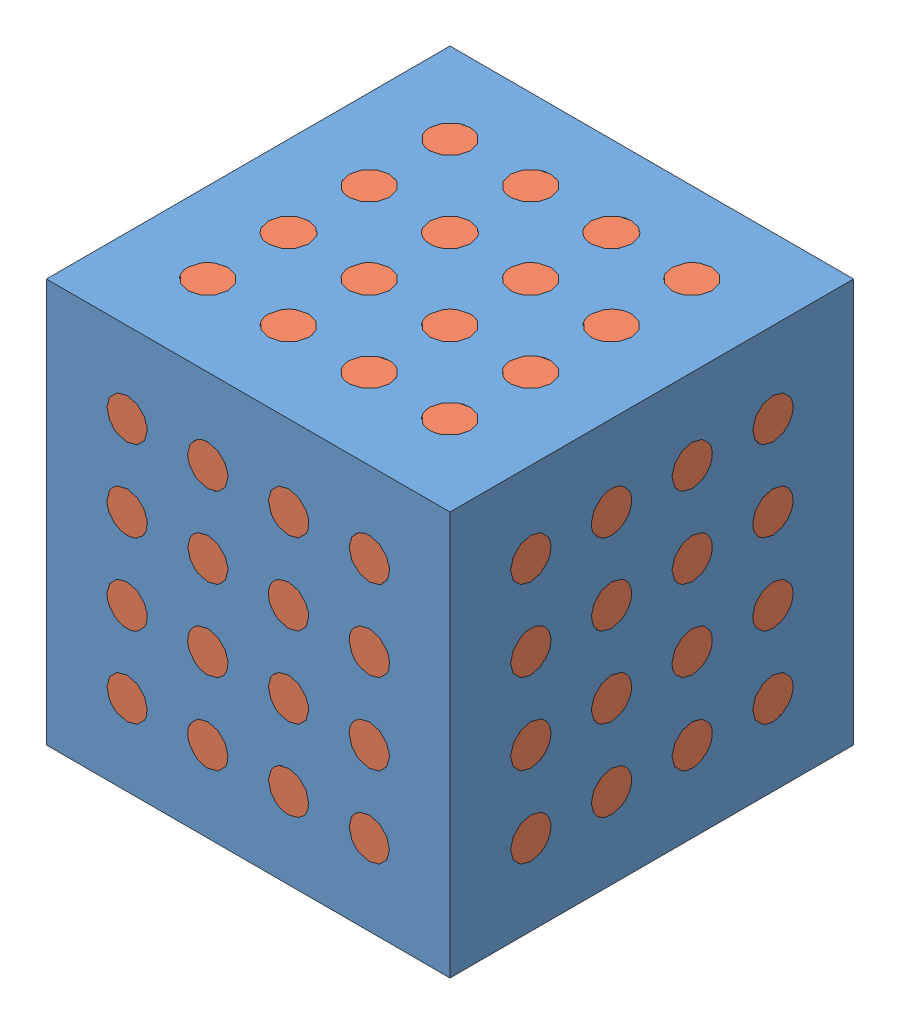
SolidWorks assembly asm_Wuerfel.SLDASM, configuration Standard (file format 4400). Lengths in mm.
Overall size (100 100 100).
49 component instances, 2 part files, 5 mates.
Components (placement in the parent):
- prt_Wuerfel-1: prt_Wuerfel.SLDPRT [Standard] at (-65.3977 -4.8678 -25) size (100 100 100)
- prt_Stopfen-1: prt_Stopfen.SLDPRT [Standard] at (-45.3977 75.1322 70) x (-0.332312 0.943169 0) z (0 0 1) size (10 10 5)
- prt_Stopfen-2: prt_Stopfen.SLDPRT [Standard] at (-45.3977 55.1322 70) x (-0.332312 0.943169 0) z (0 0 1) size (10 10 5)
- prt_Stopfen-3: prt_Stopfen.SLDPRT [Standard] at (-45.3977 35.1322 70) x (-0.332312 0.943169 0) z (0 0 1) size (10 10 5)
- prt_Stopfen-4: prt_Stopfen.SLDPRT [Standard] at (-45.3977 15.1322 70) x (-0.332312 0.943169 0) z (0 0 1) size (10 10 5)
- prt_Stopfen-5: prt_Stopfen.SLDPRT [Standard] at (-25.3977 75.1322 70) x (-0.332312 0.943169 0) z (0 0 1) size (10 10 5)
- prt_Stopfen-6: prt_Stopfen.SLDPRT [Standard] at (-25.3977 55.1322 70) x (-0.332312 0.943169 0) z (0 0 1) size (10 10 5)
- prt_Stopfen-7: prt_Stopfen.SLDPRT [Standard] at (-25.3977 35.1322 70) x (-0.332312 0.943169 0) z (0 0 1) size (10 10 5)
- prt_Stopfen-8: prt_Stopfen.SLDPRT [Standard] at (-25.3977 15.1322 70) x (-0.332312 0.943169 0) z (0 0 1) size (10 10 5)
- prt_Stopfen-9: prt_Stopfen.SLDPRT [Standard] at (-5.3977 75.1322 70) x (-0.332312 0.943169 0) z (0 0 1) size (10 10 5)
- prt_Stopfen-10: prt_Stopfen.SLDPRT [Standard] at (-5.3977 55.1322 70) x (-0.332312 0.943169 0) z (0 0 1) size (10 10 5)
- prt_Stopfen-11: prt_Stopfen.SLDPRT [Standard] at (-5.3977 35.1322 70) x (-0.332312 0.943169 0) z (0 0 1) size (10 10 5)
- prt_Stopfen-12: prt_Stopfen.SLDPRT [Standard] at (-5.3977 15.1322 70) x (-0.332312 0.943169 0) z (0 0 1) size (10 10 5)
- prt_Stopfen-13: prt_Stopfen.SLDPRT [Standard] at (14.6023 75.1322 70) x (-0.332312 0.943169 0) z (0 0 1) size (10 10 5)
- prt_Stopfen-14: prt_Stopfen.SLDPRT [Standard] at (14.6023 55.1322 70) x (-0.332312 0.943169 0) z (0 0 1) size (10 10 5)
- prt_Stopfen-15: prt_Stopfen.SLDPRT [Standard] at (14.6023 35.1322 70) x (-0.332312 0.943169 0) z (0 0 1) size (10 10 5)
- prt_Stopfen-16: prt_Stopfen.SLDPRT [Standard] at (14.6023 15.1322 70) x (-0.332312 0.943169 0) z (0 0 1) size (10 10 5)
- prt_Stopfen-17: prt_Stopfen.SLDPRT [Standard] at (29.6023 75.1322 55) x (0 -0.924225 -0.381849) z (1 0 0) size (10 10 5)
- prt_Stopfen-18: prt_Stopfen.SLDPRT [Standard] at (29.6023 55.1322 55) x (0 -0.924225 -0.381849) z (1 0 0) size (10 10 5)
- prt_Stopfen-19: prt_Stopfen.SLDPRT [Standard] at (29.6023 35.1322 55) x (0 -0.924225 -0.381849) z (1 0 0) size (10 10 5)
- prt_Stopfen-20: prt_Stopfen.SLDPRT [Standard] at (29.6023 15.1322 55) x (0 -0.924225 -0.381849) z (1 0 0) size (10 10 5)
- prt_Stopfen-21: prt_Stopfen.SLDPRT [Standard] at (29.6023 75.1322 35) x (0 -0.924225 -0.381849) z (1 0 0) size (10 10 5)
- prt_Stopfen-22: prt_Stopfen.SLDPRT [Standard] at (29.6023 55.1322 35) x (0 -0.924225 -0.381849) z (1 0 0) size (10 10 5)
- prt_Stopfen-23: prt_Stopfen.SLDPRT [Standard] at (29.6023 35.1322 35) x (0 -0.924225 -0.381849) z (1 0 0) size (10 10 5)
- prt_Stopfen-24: prt_Stopfen.SLDPRT [Standard] at (29.6023 15.1322 35) x (0 -0.924225 -0.381849) z (1 0 0) size (10 10 5)
- prt_Stopfen-25: prt_Stopfen.SLDPRT [Standard] at (29.6023 75.1322 15) x (0 -0.924225 -0.381849) z (1 0 0) size (10 10 5)
- prt_Stopfen-26: prt_Stopfen.SLDPRT [Standard] at (29.6023 55.1322 15) x (0 -0.924225 -0.381849) z (1 0 0) size (10 10 5)
- prt_Stopfen-27: prt_Stopfen.SLDPRT [Standard] at (29.6023 35.1322 15) x (0 -0.924225 -0.381849) z (1 0 0) size (10 10 5)
- prt_Stopfen-28: prt_Stopfen.SLDPRT [Standard] at (29.6023 15.1322 15) x (0 -0.924225 -0.381849) z (1 0 0) size (10 10 5)
- prt_Stopfen-29: prt_Stopfen.SLDPRT [Standard] at (29.6023 75.1322 -5) x (0 -0.924225 -0.381849) z (1 0 0) size (10 10 5)
- prt_Stopfen-30: prt_Stopfen.SLDPRT [Standard] at (29.6023 55.1322 -5) x (0 -0.924225 -0.381849) z (1 0 0) size (10 10 5)
- prt_Stopfen-31: prt_Stopfen.SLDPRT [Standard] at (29.6023 35.1322 -5) x (0 -0.924225 -0.381849) z (1 0 0) size (10 10 5)
- prt_Stopfen-32: prt_Stopfen.SLDPRT [Standard] at (29.6023 15.1322 -5) x (0 -0.924225 -0.381849) z (1 0 0) size (10 10 5)
- prt_Stopfen-33: prt_Stopfen.SLDPRT [Standard] at (-45.3977 90.1322 55) x (1 0 0) z (0 1 0) size (10 10 5)
- prt_Stopfen-34: prt_Stopfen.SLDPRT [Standard] at (-25.3977 90.1322 55) x (1 0 0) z (0 1 0) size (10 10 5)
- prt_Stopfen-35: prt_Stopfen.SLDPRT [Standard] at (-5.3977 90.1322 55) x (1 0 0) z (0 1 0) size (10 10 5)
- prt_Stopfen-36: prt_Stopfen.SLDPRT [Standard] at (14.6023 90.1322 55) x (1 0 0) z (0 1 0) size (10 10 5)
- prt_Stopfen-37: prt_Stopfen.SLDPRT [Standard] at (-45.3977 90.1322 35) x (1 0 0) z (0 1 0) size (10 10 5)
- prt_Stopfen-38: prt_Stopfen.SLDPRT [Standard] at (-25.3977 90.1322 35) x (1 0 0) z (0 1 0) size (10 10 5)
- prt_Stopfen-39: prt_Stopfen.SLDPRT [Standard] at (-5.3977 90.1322 35) x (1 0 0) z (0 1 0) size (10 10 5)
- prt_Stopfen-40: prt_Stopfen.SLDPRT [Standard] at (14.6023 90.1322 35) x (1 0 0) z (0 1 0) size (10 10 5)
- prt_Stopfen-41: prt_Stopfen.SLDPRT [Standard] at (-45.3977 90.1322 15) x (1 0 0) z (0 1 0) size (10 10 5)
- prt_Stopfen-42: prt_Stopfen.SLDPRT [Standard] at (-25.3977 90.1322 15) x (1 0 0) z (0 1 0) size (10 10 5)
- prt_Stopfen-43: prt_Stopfen.SLDPRT [Standard] at (-5.3977 90.1322 15) x (1 0 0) z (0 1 0) size (10 10 5)
- prt_Stopfen-44: prt_Stopfen.SLDPRT [Standard] at (14.6023 90.1322 15) x (1 0 0) z (0 1 0) size (10 10 5)
- prt_Stopfen-45: prt_Stopfen.SLDPRT [Standard] at (-45.3977 90.1322 -5) x (1 0 0) z (0 1 0) size (10 10 5)
- prt_Stopfen-46: prt_Stopfen.SLDPRT [Standard] at (-25.3977 90.1322 -5) x (1 0 0) z (0 1 0) size (10 10 5)
- prt_Stopfen-47: prt_Stopfen.SLDPRT [Standard] at (-5.3977 90.1322 -5) x (1 0 0) z (0 1 0) size (10 10 5)
- prt_Stopfen-48: prt_Stopfen.SLDPRT [Standard] at (14.6023 90.1322 -5) x (1 0 0) z (0 1 0) size (10 10 5)
Mates (geometry in assembly coordinates):
- Deckungsgleich2: coincident aligned: circle of prt_Wuerfel-1; circle of prt_Stopfen-17
- Deckungsgleich3: coincident aligned: circle of prt_Wuerfel-1; circle of prt_Stopfen-33
- Deckungsgleich4: coincident aligned: circle of prt_Wuerfel-1; circle of prt_Stopfen-1
- Lokales lineares Muster2: unknown: line of prt_Wuerfel-1 through (34.6023 95.1322 75) axis (0 0 -1); line of prt_Wuerfel-1 through (34.6023 -4.8678 75) axis (0 1 0)
- Lokales lineares Muster3: unknown: line of prt_Wuerfel-1 through (-65.3977 95.1322 75) axis (0 0 -1); line of prt_Wuerfel-1 through (34.6023 95.1322 75) axis (-1 0 0)
